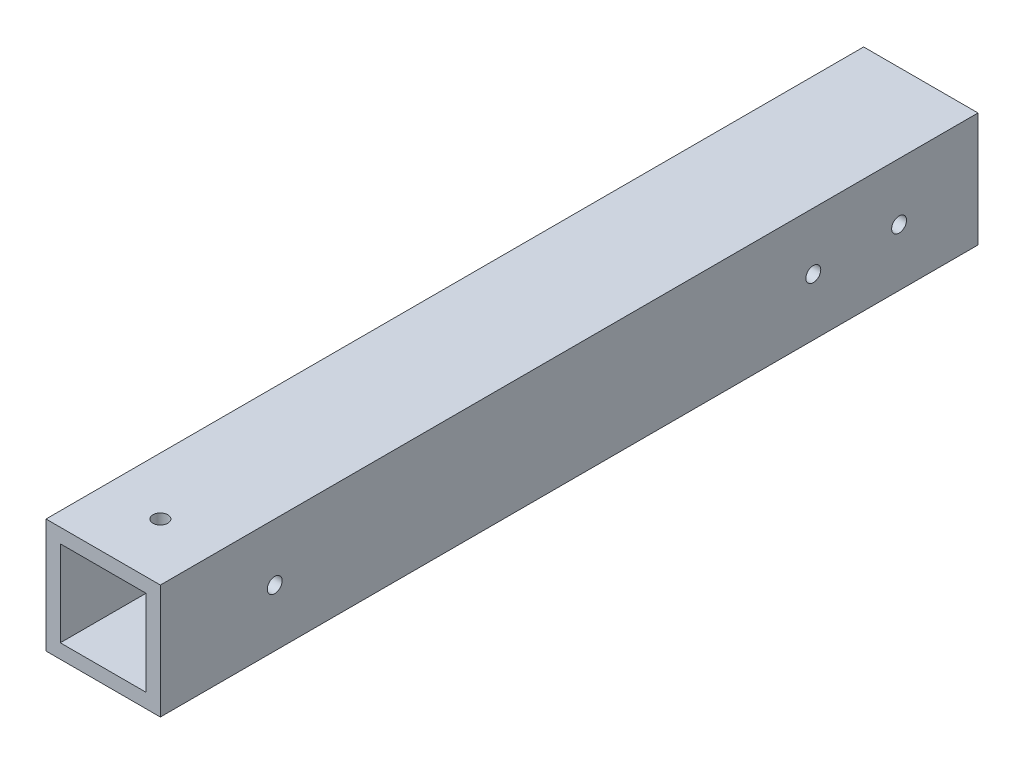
ISO-10303-21;
HEADER;
FILE_DESCRIPTION(('STEP AP214'),'2;1');
FILE_NAME('part.step','',(''),(''),'','','');
FILE_SCHEMA(('AUTOMOTIVE_DESIGN { 1 0 10303 214 1 1 1 1 }'));
ENDSEC;
DATA;
#1=APPLICATION_CONTEXT('core data for automotive mechanical design processes');
#2=APPLICATION_PROTOCOL_DEFINITION('international standard','automotive_design',2000,#1);
#3=PRODUCT_CONTEXT('',#1,'mechanical');
#4=PRODUCT('Part','Part','',(#3));
#5=PRODUCT_RELATED_PRODUCT_CATEGORY('part','',(#4));
#6=PRODUCT_DEFINITION_FORMATION('','',#4);
#7=PRODUCT_DEFINITION_CONTEXT('part definition',#1,'design');
#8=PRODUCT_DEFINITION('design','',#6,#7);
#9=PRODUCT_DEFINITION_SHAPE('','',#8);
#10=(LENGTH_UNIT() NAMED_UNIT(*) SI_UNIT(.MILLI.,.METRE.));
#11=(NAMED_UNIT(*) PLANE_ANGLE_UNIT() SI_UNIT($,.RADIAN.));
#12=(NAMED_UNIT(*) SI_UNIT($,.STERADIAN.) SOLID_ANGLE_UNIT());
#13=UNCERTAINTY_MEASURE_WITH_UNIT(LENGTH_MEASURE(1.E-05),#10,'distance_accuracy_value','');
#14=(GEOMETRIC_REPRESENTATION_CONTEXT(3) GLOBAL_UNCERTAINTY_ASSIGNED_CONTEXT((#13)) GLOBAL_UNIT_ASSIGNED_CONTEXT((#10,
#11,#12)) REPRESENTATION_CONTEXT('',''));
#15=CARTESIAN_POINT('',(0.,0.,0.));
#16=DIRECTION('',(0.,0.,1.));
#17=DIRECTION('',(1.,0.,0.));
#18=AXIS2_PLACEMENT_3D('',#15,#16,#17);
#19=CARTESIAN_POINT('',(0.,0.,-363.22));
#20=DIRECTION('',(-1.,0.,0.));
#21=DIRECTION('',(0.,0.,1.));
#22=AXIS2_PLACEMENT_3D('',#19,#20,#21);
#23=PLANE('',#22);
#24=CARTESIAN_POINT('',(0.,25.4,-328.168));
#25=DIRECTION('',(1.,0.,0.));
#26=DIRECTION('',(0.,0.,-1.));
#27=AXIS2_PLACEMENT_3D('',#24,#25,#26);
#28=CIRCLE('',#27,3.30200000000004);
#29=CARTESIAN_POINT('',(0.,25.4,-331.47));
#30=VERTEX_POINT('',#29);
#31=EDGE_CURVE('E241',#30,#30,#28,.T.);
#32=ORIENTED_EDGE('',*,*,#31,.T.);
#33=EDGE_LOOP('',(#32));
#34=FACE_BOUND('',#33,.T.);
#35=CARTESIAN_POINT('',(0.,25.4,-290.068));
#36=DIRECTION('',(1.,0.,0.));
#37=DIRECTION('',(0.,0.,-1.));
#38=AXIS2_PLACEMENT_3D('',#35,#36,#37);
#39=CIRCLE('',#38,3.30200000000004);
#40=CARTESIAN_POINT('',(0.,25.4,-293.37));
#41=VERTEX_POINT('',#40);
#42=EDGE_CURVE('E176',#41,#41,#39,.T.);
#43=ORIENTED_EDGE('',*,*,#42,.T.);
#44=EDGE_LOOP('',(#43));
#45=FACE_BOUND('',#44,.T.);
#46=CARTESIAN_POINT('',(0.,25.4,-50.8));
#47=DIRECTION('',(1.,0.,0.));
#48=DIRECTION('',(0.,0.,-1.));
#49=AXIS2_PLACEMENT_3D('',#46,#47,#48);
#50=CIRCLE('',#49,3.302);
#51=CARTESIAN_POINT('',(0.,25.4,-54.102));
#52=VERTEX_POINT('',#51);
#53=EDGE_CURVE('E172',#52,#52,#50,.T.);
#54=ORIENTED_EDGE('',*,*,#53,.T.);
#55=EDGE_LOOP('',(#54));
#56=FACE_BOUND('',#55,.T.);
#57=DIRECTION('',(0.,-1.,0.));
#58=VECTOR('',#57,1.);
#59=CARTESIAN_POINT('',(0.,0.,0.));
#60=LINE('',#59,#58);
#61=CARTESIAN_POINT('',(0.,50.8,0.));
#62=VERTEX_POINT('',#61);
#63=CARTESIAN_POINT('',(0.,0.,0.));
#64=VERTEX_POINT('',#63);
#65=EDGE_CURVE('E133',#62,#64,#60,.T.);
#66=ORIENTED_EDGE('',*,*,#65,.F.);
#67=DIRECTION('',(0.,0.,1.));
#68=VECTOR('',#67,1.);
#69=CARTESIAN_POINT('',(0.,50.8,-363.22));
#70=LINE('',#69,#68);
#71=CARTESIAN_POINT('',(0.,50.8,-363.22));
#72=VERTEX_POINT('',#71);
#73=EDGE_CURVE('E11',#72,#62,#70,.T.);
#74=ORIENTED_EDGE('',*,*,#73,.F.);
#75=DIRECTION('',(0.,-1.,0.));
#76=VECTOR('',#75,1.);
#77=CARTESIAN_POINT('',(0.,0.,-363.22));
#78=LINE('',#77,#76);
#79=CARTESIAN_POINT('',(0.,0.,-363.22));
#80=VERTEX_POINT('',#79);
#81=EDGE_CURVE('E137',#72,#80,#78,.T.);
#82=ORIENTED_EDGE('',*,*,#81,.T.);
#83=DIRECTION('',(0.,0.,1.));
#84=VECTOR('',#83,1.);
#85=CARTESIAN_POINT('',(0.,0.,-363.22));
#86=LINE('',#85,#84);
#87=EDGE_CURVE('E150',#80,#64,#86,.T.);
#88=ORIENTED_EDGE('',*,*,#87,.T.);
#89=EDGE_LOOP('',(#66,#74,#82,#88));
#90=FACE_BOUND('',#89,.T.);
#91=ADVANCED_FACE('F32',(#34,#45,#56,#90),#23,.T.);
#92=CARTESIAN_POINT('',(0.,50.8,-363.22));
#93=DIRECTION('',(0.,1.,0.));
#94=DIRECTION('',(0.,0.,1.));
#95=AXIS2_PLACEMENT_3D('',#92,#93,#94);
#96=PLANE('',#95);
#97=CARTESIAN_POINT('',(25.4,50.8,-25.4));
#98=DIRECTION('',(0.,1.,0.));
#99=DIRECTION('',(0.,0.,1.));
#100=AXIS2_PLACEMENT_3D('',#97,#98,#99);
#101=CIRCLE('',#100,3.302);
#102=CARTESIAN_POINT('',(25.4,50.8,-22.098));
#103=VERTEX_POINT('',#102);
#104=EDGE_CURVE('E199',#103,#103,#101,.T.);
#105=ORIENTED_EDGE('',*,*,#104,.F.);
#106=EDGE_LOOP('',(#105));
#107=FACE_BOUND('',#106,.T.);
#108=DIRECTION('',(-1.,0.,0.));
#109=VECTOR('',#108,1.);
#110=CARTESIAN_POINT('',(0.,50.8,0.));
#111=LINE('',#110,#109);
#112=CARTESIAN_POINT('',(50.8,50.8,0.));
#113=VERTEX_POINT('',#112);
#114=EDGE_CURVE('E141',#113,#62,#111,.T.);
#115=ORIENTED_EDGE('',*,*,#114,.F.);
#116=DIRECTION('',(0.,0.,1.));
#117=VECTOR('',#116,1.);
#118=CARTESIAN_POINT('',(50.8,50.8,-363.22));
#119=LINE('',#118,#117);
#120=CARTESIAN_POINT('',(50.8,50.8,-363.22));
#121=VERTEX_POINT('',#120);
#122=EDGE_CURVE('E40',#121,#113,#119,.T.);
#123=ORIENTED_EDGE('',*,*,#122,.F.);
#124=DIRECTION('',(-1.,0.,0.));
#125=VECTOR('',#124,1.);
#126=CARTESIAN_POINT('',(0.,50.8,-363.22));
#127=LINE('',#126,#125);
#128=EDGE_CURVE('E147',#121,#72,#127,.T.);
#129=ORIENTED_EDGE('',*,*,#128,.T.);
#130=ORIENTED_EDGE('',*,*,#73,.T.);
#131=EDGE_LOOP('',(#115,#123,#129,#130));
#132=FACE_BOUND('',#131,.T.);
#133=ADVANCED_FACE('F207',(#107,#132),#96,.T.);
#134=CARTESIAN_POINT('',(50.8,0.,-363.22));
#135=DIRECTION('',(1.,0.,0.));
#136=DIRECTION('',(0.,0.,-1.));
#137=AXIS2_PLACEMENT_3D('',#134,#135,#136);
#138=PLANE('',#137);
#139=CARTESIAN_POINT('',(50.8,25.4,-328.168));
#140=DIRECTION('',(1.,0.,0.));
#141=DIRECTION('',(0.,0.,-1.));
#142=AXIS2_PLACEMENT_3D('',#139,#140,#141);
#143=CIRCLE('',#142,3.30200000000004);
#144=CARTESIAN_POINT('',(50.8,25.4,-331.47));
#145=VERTEX_POINT('',#144);
#146=EDGE_CURVE('E294',#145,#145,#143,.T.);
#147=ORIENTED_EDGE('',*,*,#146,.F.);
#148=EDGE_LOOP('',(#147));
#149=FACE_BOUND('',#148,.T.);
#150=CARTESIAN_POINT('',(50.8,25.4,-290.068));
#151=DIRECTION('',(1.,0.,0.));
#152=DIRECTION('',(0.,0.,-1.));
#153=AXIS2_PLACEMENT_3D('',#150,#151,#152);
#154=CIRCLE('',#153,3.30200000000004);
#155=CARTESIAN_POINT('',(50.8,25.4,-293.37));
#156=VERTEX_POINT('',#155);
#157=EDGE_CURVE('E183',#156,#156,#154,.T.);
#158=ORIENTED_EDGE('',*,*,#157,.F.);
#159=EDGE_LOOP('',(#158));
#160=FACE_BOUND('',#159,.T.);
#161=CARTESIAN_POINT('',(50.8,25.4,-50.8));
#162=DIRECTION('',(1.,0.,0.));
#163=DIRECTION('',(0.,0.,-1.));
#164=AXIS2_PLACEMENT_3D('',#161,#162,#163);
#165=CIRCLE('',#164,3.302);
#166=CARTESIAN_POINT('',(50.8,25.4,-54.102));
#167=VERTEX_POINT('',#166);
#168=EDGE_CURVE('E180',#167,#167,#165,.T.);
#169=ORIENTED_EDGE('',*,*,#168,.F.);
#170=EDGE_LOOP('',(#169));
#171=FACE_BOUND('',#170,.T.);
#172=DIRECTION('',(0.,1.,0.));
#173=VECTOR('',#172,1.);
#174=CARTESIAN_POINT('',(50.8,0.,0.));
#175=LINE('',#174,#173);
#176=CARTESIAN_POINT('',(50.8,0.,0.));
#177=VERTEX_POINT('',#176);
#178=EDGE_CURVE('E156',#177,#113,#175,.T.);
#179=ORIENTED_EDGE('',*,*,#178,.F.);
#180=DIRECTION('',(0.,0.,1.));
#181=VECTOR('',#180,1.);
#182=CARTESIAN_POINT('',(50.8,0.,-363.22));
#183=LINE('',#182,#181);
#184=CARTESIAN_POINT('',(50.8,0.,-363.22));
#185=VERTEX_POINT('',#184);
#186=EDGE_CURVE('E162',#185,#177,#183,.T.);
#187=ORIENTED_EDGE('',*,*,#186,.F.);
#188=DIRECTION('',(0.,1.,0.));
#189=VECTOR('',#188,1.);
#190=CARTESIAN_POINT('',(50.8,0.,-363.22));
#191=LINE('',#190,#189);
#192=EDGE_CURVE('E144',#185,#121,#191,.T.);
#193=ORIENTED_EDGE('',*,*,#192,.T.);
#194=ORIENTED_EDGE('',*,*,#122,.T.);
#195=EDGE_LOOP('',(#179,#187,#193,#194));
#196=FACE_BOUND('',#195,.T.);
#197=ADVANCED_FACE('F210',(#149,#160,#171,#196),#138,.T.);
#198=CARTESIAN_POINT('',(0.,0.,-363.22));
#199=DIRECTION('',(0.,-1.,0.));
#200=DIRECTION('',(0.,0.,-1.));
#201=AXIS2_PLACEMENT_3D('',#198,#199,#200);
#202=PLANE('',#201);
#203=CARTESIAN_POINT('',(25.4,0.,-25.4));
#204=DIRECTION('',(0.,1.,0.));
#205=DIRECTION('',(0.,0.,1.));
#206=AXIS2_PLACEMENT_3D('',#203,#204,#205);
#207=CIRCLE('',#206,3.302);
#208=CARTESIAN_POINT('',(25.4,0.,-22.098));
#209=VERTEX_POINT('',#208);
#210=EDGE_CURVE('E168',#209,#209,#207,.T.);
#211=ORIENTED_EDGE('',*,*,#210,.T.);
#212=EDGE_LOOP('',(#211));
#213=FACE_BOUND('',#212,.T.);
#214=DIRECTION('',(1.,0.,0.));
#215=VECTOR('',#214,1.);
#216=CARTESIAN_POINT('',(0.,0.,0.));
#217=LINE('',#216,#215);
#218=EDGE_CURVE('E153',#64,#177,#217,.T.);
#219=ORIENTED_EDGE('',*,*,#218,.F.);
#220=ORIENTED_EDGE('',*,*,#87,.F.);
#221=DIRECTION('',(1.,0.,0.));
#222=VECTOR('',#221,1.);
#223=CARTESIAN_POINT('',(0.,0.,-363.22));
#224=LINE('',#223,#222);
#225=EDGE_CURVE('E140',#80,#185,#224,.T.);
#226=ORIENTED_EDGE('',*,*,#225,.T.);
#227=ORIENTED_EDGE('',*,*,#186,.T.);
#228=EDGE_LOOP('',(#219,#220,#226,#227));
#229=FACE_BOUND('',#228,.T.);
#230=ADVANCED_FACE('F225',(#213,#229),#202,.T.);
#231=CARTESIAN_POINT('',(0.,50.8,-363.22));
#232=DIRECTION('',(0.,0.,-1.));
#233=DIRECTION('',(-1.,0.,0.));
#234=AXIS2_PLACEMENT_3D('',#231,#232,#233);
#235=PLANE('',#234);
#236=DIRECTION('',(0.,-1.,0.));
#237=VECTOR('',#236,1.);
#238=CARTESIAN_POINT('',(6.35,6.35,-363.22));
#239=LINE('',#238,#237);
#240=CARTESIAN_POINT('',(6.35,44.45,-363.22));
#241=VERTEX_POINT('',#240);
#242=CARTESIAN_POINT('',(6.35,6.35,-363.22));
#243=VERTEX_POINT('',#242);
#244=EDGE_CURVE('E99',#241,#243,#239,.T.);
#245=ORIENTED_EDGE('',*,*,#244,.T.);
#246=DIRECTION('',(1.,0.,0.));
#247=VECTOR('',#246,1.);
#248=CARTESIAN_POINT('',(6.35,6.35,-363.22));
#249=LINE('',#248,#247);
#250=CARTESIAN_POINT('',(44.45,6.35,-363.22));
#251=VERTEX_POINT('',#250);
#252=EDGE_CURVE('E108',#243,#251,#249,.T.);
#253=ORIENTED_EDGE('',*,*,#252,.T.);
#254=DIRECTION('',(0.,1.,0.));
#255=VECTOR('',#254,1.);
#256=CARTESIAN_POINT('',(44.45,6.35,-363.22));
#257=LINE('',#256,#255);
#258=CARTESIAN_POINT('',(44.45,44.45,-363.22));
#259=VERTEX_POINT('',#258);
#260=EDGE_CURVE('E48',#251,#259,#257,.T.);
#261=ORIENTED_EDGE('',*,*,#260,.T.);
#262=DIRECTION('',(-1.,0.,0.));
#263=VECTOR('',#262,1.);
#264=CARTESIAN_POINT('',(6.35,44.45,-363.22));
#265=LINE('',#264,#263);
#266=EDGE_CURVE('E105',#259,#241,#265,.T.);
#267=ORIENTED_EDGE('',*,*,#266,.T.);
#268=EDGE_LOOP('',(#245,#253,#261,#267));
#269=FACE_BOUND('',#268,.T.);
#270=ORIENTED_EDGE('',*,*,#81,.F.);
#271=ORIENTED_EDGE('',*,*,#128,.F.);
#272=ORIENTED_EDGE('',*,*,#192,.F.);
#273=ORIENTED_EDGE('',*,*,#225,.F.);
#274=EDGE_LOOP('',(#270,#271,#272,#273));
#275=FACE_BOUND('',#274,.T.);
#276=ADVANCED_FACE('F112',(#269,#275),#235,.T.);
#277=CARTESIAN_POINT('',(0.,50.8,0.));
#278=DIRECTION('',(0.,0.,-1.));
#279=DIRECTION('',(-1.,0.,0.));
#280=AXIS2_PLACEMENT_3D('',#277,#278,#279);
#281=PLANE('',#280);
#282=DIRECTION('',(1.,0.,0.));
#283=VECTOR('',#282,1.);
#284=CARTESIAN_POINT('',(6.35,6.35,0.));
#285=LINE('',#284,#283);
#286=CARTESIAN_POINT('',(6.35,6.35,0.));
#287=VERTEX_POINT('',#286);
#288=CARTESIAN_POINT('',(44.45,6.35,0.));
#289=VERTEX_POINT('',#288);
#290=EDGE_CURVE('E127',#287,#289,#285,.T.);
#291=ORIENTED_EDGE('',*,*,#290,.F.);
#292=DIRECTION('',(0.,-1.,0.));
#293=VECTOR('',#292,1.);
#294=CARTESIAN_POINT('',(6.35,6.35,0.));
#295=LINE('',#294,#293);
#296=CARTESIAN_POINT('',(6.35,44.45,0.));
#297=VERTEX_POINT('',#296);
#298=EDGE_CURVE('E56',#297,#287,#295,.T.);
#299=ORIENTED_EDGE('',*,*,#298,.F.);
#300=DIRECTION('',(-1.,0.,0.));
#301=VECTOR('',#300,1.);
#302=CARTESIAN_POINT('',(6.35,44.45,0.));
#303=LINE('',#302,#301);
#304=CARTESIAN_POINT('',(44.45,44.45,0.));
#305=VERTEX_POINT('',#304);
#306=EDGE_CURVE('E115',#305,#297,#303,.T.);
#307=ORIENTED_EDGE('',*,*,#306,.F.);
#308=DIRECTION('',(0.,1.,0.));
#309=VECTOR('',#308,1.);
#310=CARTESIAN_POINT('',(44.45,6.35,0.));
#311=LINE('',#310,#309);
#312=EDGE_CURVE('E118',#289,#305,#311,.T.);
#313=ORIENTED_EDGE('',*,*,#312,.F.);
#314=EDGE_LOOP('',(#291,#299,#307,#313));
#315=FACE_BOUND('',#314,.T.);
#316=ORIENTED_EDGE('',*,*,#65,.T.);
#317=ORIENTED_EDGE('',*,*,#218,.T.);
#318=ORIENTED_EDGE('',*,*,#178,.T.);
#319=ORIENTED_EDGE('',*,*,#114,.T.);
#320=EDGE_LOOP('',(#316,#317,#318,#319));
#321=FACE_BOUND('',#320,.T.);
#322=ADVANCED_FACE('F215',(#315,#321),#281,.F.);
#323=CARTESIAN_POINT('',(6.35,6.35,-363.22));
#324=DIRECTION('',(-1.,0.,0.));
#325=DIRECTION('',(0.,0.,1.));
#326=AXIS2_PLACEMENT_3D('',#323,#324,#325);
#327=PLANE('',#326);
#328=CARTESIAN_POINT('',(6.35,25.4,-328.168));
#329=DIRECTION('',(-1.,0.,0.));
#330=DIRECTION('',(0.,0.,1.));
#331=AXIS2_PLACEMENT_3D('',#328,#329,#330);
#332=CIRCLE('',#331,3.30200000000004);
#333=CARTESIAN_POINT('',(6.35,25.4,-324.866));
#334=VERTEX_POINT('',#333);
#335=EDGE_CURVE('E188',#334,#334,#332,.T.);
#336=ORIENTED_EDGE('',*,*,#335,.T.);
#337=EDGE_LOOP('',(#336));
#338=FACE_BOUND('',#337,.T.);
#339=CARTESIAN_POINT('',(6.35,25.4,-290.068));
#340=DIRECTION('',(-1.,0.,0.));
#341=DIRECTION('',(0.,0.,1.));
#342=AXIS2_PLACEMENT_3D('',#339,#340,#341);
#343=CIRCLE('',#342,3.30200000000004);
#344=CARTESIAN_POINT('',(6.35,25.4,-286.766));
#345=VERTEX_POINT('',#344);
#346=EDGE_CURVE('E175',#345,#345,#343,.T.);
#347=ORIENTED_EDGE('',*,*,#346,.T.);
#348=EDGE_LOOP('',(#347));
#349=FACE_BOUND('',#348,.T.);
#350=CARTESIAN_POINT('',(6.35,25.4,-50.8));
#351=DIRECTION('',(-1.,0.,0.));
#352=DIRECTION('',(0.,0.,1.));
#353=AXIS2_PLACEMENT_3D('',#350,#351,#352);
#354=CIRCLE('',#353,3.302);
#355=CARTESIAN_POINT('',(6.35,25.4,-47.498));
#356=VERTEX_POINT('',#355);
#357=EDGE_CURVE('E171',#356,#356,#354,.T.);
#358=ORIENTED_EDGE('',*,*,#357,.T.);
#359=EDGE_LOOP('',(#358));
#360=FACE_BOUND('',#359,.T.);
#361=ORIENTED_EDGE('',*,*,#298,.T.);
#362=DIRECTION('',(0.,0.,1.));
#363=VECTOR('',#362,1.);
#364=CARTESIAN_POINT('',(6.35,6.35,-363.22));
#365=LINE('',#364,#363);
#366=EDGE_CURVE('E95',#243,#287,#365,.T.);
#367=ORIENTED_EDGE('',*,*,#366,.F.);
#368=ORIENTED_EDGE('',*,*,#244,.F.);
#369=DIRECTION('',(0.,0.,1.));
#370=VECTOR('',#369,1.);
#371=CARTESIAN_POINT('',(6.35,44.45,-363.22));
#372=LINE('',#371,#370);
#373=EDGE_CURVE('E131',#241,#297,#372,.T.);
#374=ORIENTED_EDGE('',*,*,#373,.T.);
#375=EDGE_LOOP('',(#361,#367,#368,#374));
#376=FACE_BOUND('',#375,.T.);
#377=ADVANCED_FACE('F97',(#338,#349,#360,#376),#327,.F.);
#378=CARTESIAN_POINT('',(6.35,44.45,-363.22));
#379=DIRECTION('',(0.,1.,0.));
#380=DIRECTION('',(0.,0.,1.));
#381=AXIS2_PLACEMENT_3D('',#378,#379,#380);
#382=PLANE('',#381);
#383=CARTESIAN_POINT('',(25.4,44.45,-25.4));
#384=DIRECTION('',(0.,1.,0.));
#385=DIRECTION('',(0.,0.,1.));
#386=AXIS2_PLACEMENT_3D('',#383,#384,#385);
#387=CIRCLE('',#386,3.302);
#388=CARTESIAN_POINT('',(25.4,44.45,-22.098));
#389=VERTEX_POINT('',#388);
#390=EDGE_CURVE('E121',#389,#389,#387,.T.);
#391=ORIENTED_EDGE('',*,*,#390,.T.);
#392=EDGE_LOOP('',(#391));
#393=FACE_BOUND('',#392,.T.);
#394=ORIENTED_EDGE('',*,*,#306,.T.);
#395=ORIENTED_EDGE('',*,*,#373,.F.);
#396=ORIENTED_EDGE('',*,*,#266,.F.);
#397=DIRECTION('',(0.,0.,1.));
#398=VECTOR('',#397,1.);
#399=CARTESIAN_POINT('',(44.45,44.45,-363.22));
#400=LINE('',#399,#398);
#401=EDGE_CURVE('E134',#259,#305,#400,.T.);
#402=ORIENTED_EDGE('',*,*,#401,.T.);
#403=EDGE_LOOP('',(#394,#395,#396,#402));
#404=FACE_BOUND('',#403,.T.);
#405=ADVANCED_FACE('F254',(#393,#404),#382,.F.);
#406=CARTESIAN_POINT('',(44.45,6.35,-363.22));
#407=DIRECTION('',(1.,0.,0.));
#408=DIRECTION('',(0.,0.,-1.));
#409=AXIS2_PLACEMENT_3D('',#406,#407,#408);
#410=PLANE('',#409);
#411=CARTESIAN_POINT('',(44.45,25.4,-328.168));
#412=DIRECTION('',(1.,0.,0.));
#413=DIRECTION('',(0.,0.,-1.));
#414=AXIS2_PLACEMENT_3D('',#411,#412,#413);
#415=CIRCLE('',#414,3.30200000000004);
#416=CARTESIAN_POINT('',(44.45,25.4,-331.47));
#417=VERTEX_POINT('',#416);
#418=EDGE_CURVE('E35',#417,#417,#415,.T.);
#419=ORIENTED_EDGE('',*,*,#418,.T.);
#420=EDGE_LOOP('',(#419));
#421=FACE_BOUND('',#420,.T.);
#422=CARTESIAN_POINT('',(44.45,25.4,-290.068));
#423=DIRECTION('',(1.,0.,0.));
#424=DIRECTION('',(0.,0.,-1.));
#425=AXIS2_PLACEMENT_3D('',#422,#423,#424);
#426=CIRCLE('',#425,3.30200000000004);
#427=CARTESIAN_POINT('',(44.45,25.4,-293.37));
#428=VERTEX_POINT('',#427);
#429=EDGE_CURVE('E173',#428,#428,#426,.T.);
#430=ORIENTED_EDGE('',*,*,#429,.T.);
#431=EDGE_LOOP('',(#430));
#432=FACE_BOUND('',#431,.T.);
#433=CARTESIAN_POINT('',(44.45,25.4,-50.8));
#434=DIRECTION('',(1.,0.,0.));
#435=DIRECTION('',(0.,0.,-1.));
#436=AXIS2_PLACEMENT_3D('',#433,#434,#435);
#437=CIRCLE('',#436,3.302);
#438=CARTESIAN_POINT('',(44.45,25.4,-54.102));
#439=VERTEX_POINT('',#438);
#440=EDGE_CURVE('E169',#439,#439,#437,.T.);
#441=ORIENTED_EDGE('',*,*,#440,.T.);
#442=EDGE_LOOP('',(#441));
#443=FACE_BOUND('',#442,.T.);
#444=ORIENTED_EDGE('',*,*,#312,.T.);
#445=ORIENTED_EDGE('',*,*,#401,.F.);
#446=ORIENTED_EDGE('',*,*,#260,.F.);
#447=DIRECTION('',(0.,0.,1.));
#448=VECTOR('',#447,1.);
#449=CARTESIAN_POINT('',(44.45,6.35,-363.22));
#450=LINE('',#449,#448);
#451=EDGE_CURVE('E104',#251,#289,#450,.T.);
#452=ORIENTED_EDGE('',*,*,#451,.T.);
#453=EDGE_LOOP('',(#444,#445,#446,#452));
#454=FACE_BOUND('',#453,.T.);
#455=ADVANCED_FACE('F261',(#421,#432,#443,#454),#410,.F.);
#456=CARTESIAN_POINT('',(6.35,6.35,-363.22));
#457=DIRECTION('',(0.,-1.,0.));
#458=DIRECTION('',(0.,0.,-1.));
#459=AXIS2_PLACEMENT_3D('',#456,#457,#458);
#460=PLANE('',#459);
#461=CARTESIAN_POINT('',(25.4,6.35,-25.4));
#462=DIRECTION('',(0.,-1.,0.));
#463=DIRECTION('',(0.,0.,-1.));
#464=AXIS2_PLACEMENT_3D('',#461,#462,#463);
#465=CIRCLE('',#464,3.302);
#466=CARTESIAN_POINT('',(25.4,6.35,-28.702));
#467=VERTEX_POINT('',#466);
#468=EDGE_CURVE('E165',#467,#467,#465,.T.);
#469=ORIENTED_EDGE('',*,*,#468,.T.);
#470=EDGE_LOOP('',(#469));
#471=FACE_BOUND('',#470,.T.);
#472=ORIENTED_EDGE('',*,*,#290,.T.);
#473=ORIENTED_EDGE('',*,*,#451,.F.);
#474=ORIENTED_EDGE('',*,*,#252,.F.);
#475=ORIENTED_EDGE('',*,*,#366,.T.);
#476=EDGE_LOOP('',(#472,#473,#474,#475));
#477=FACE_BOUND('',#476,.T.);
#478=ADVANCED_FACE('F109',(#471,#477),#460,.F.);
#479=CARTESIAN_POINT('',(25.4,0.,-25.4));
#480=DIRECTION('',(0.,1.,0.));
#481=DIRECTION('',(0.,0.,1.));
#482=AXIS2_PLACEMENT_3D('',#479,#480,#481);
#483=CYLINDRICAL_SURFACE('',#482,3.302);
#484=ORIENTED_EDGE('',*,*,#210,.F.);
#485=EDGE_LOOP('',(#484));
#486=FACE_BOUND('',#485,.T.);
#487=ORIENTED_EDGE('',*,*,#468,.F.);
#488=EDGE_LOOP('',(#487));
#489=FACE_BOUND('',#488,.T.);
#490=ADVANCED_FACE('F271',(#486,#489),#483,.F.);
#491=ORIENTED_EDGE('',*,*,#104,.T.);
#492=EDGE_LOOP('',(#491));
#493=FACE_BOUND('',#492,.T.);
#494=ORIENTED_EDGE('',*,*,#390,.F.);
#495=EDGE_LOOP('',(#494));
#496=FACE_BOUND('',#495,.T.);
#497=ADVANCED_FACE('F204',(#493,#496),#483,.F.);
#498=CARTESIAN_POINT('',(0.,25.4,-50.8));
#499=DIRECTION('',(1.,0.,0.));
#500=DIRECTION('',(0.,0.,-1.));
#501=AXIS2_PLACEMENT_3D('',#498,#499,#500);
#502=CYLINDRICAL_SURFACE('',#501,3.302);
#503=ORIENTED_EDGE('',*,*,#168,.T.);
#504=EDGE_LOOP('',(#503));
#505=FACE_BOUND('',#504,.T.);
#506=ORIENTED_EDGE('',*,*,#440,.F.);
#507=EDGE_LOOP('',(#506));
#508=FACE_BOUND('',#507,.T.);
#509=ADVANCED_FACE('F249',(#505,#508),#502,.F.);
#510=ORIENTED_EDGE('',*,*,#53,.F.);
#511=EDGE_LOOP('',(#510));
#512=FACE_BOUND('',#511,.T.);
#513=ORIENTED_EDGE('',*,*,#357,.F.);
#514=EDGE_LOOP('',(#513));
#515=FACE_BOUND('',#514,.T.);
#516=ADVANCED_FACE('F245',(#512,#515),#502,.F.);
#517=CARTESIAN_POINT('',(0.,25.4,-290.068));
#518=DIRECTION('',(1.,0.,0.));
#519=DIRECTION('',(0.,0.,-1.));
#520=AXIS2_PLACEMENT_3D('',#517,#518,#519);
#521=CYLINDRICAL_SURFACE('',#520,3.30200000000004);
#522=ORIENTED_EDGE('',*,*,#157,.T.);
#523=EDGE_LOOP('',(#522));
#524=FACE_BOUND('',#523,.T.);
#525=ORIENTED_EDGE('',*,*,#429,.F.);
#526=EDGE_LOOP('',(#525));
#527=FACE_BOUND('',#526,.T.);
#528=ADVANCED_FACE('F248',(#524,#527),#521,.F.);
#529=ORIENTED_EDGE('',*,*,#42,.F.);
#530=EDGE_LOOP('',(#529));
#531=FACE_BOUND('',#530,.T.);
#532=ORIENTED_EDGE('',*,*,#346,.F.);
#533=EDGE_LOOP('',(#532));
#534=FACE_BOUND('',#533,.T.);
#535=ADVANCED_FACE('F278',(#531,#534),#521,.F.);
#536=CARTESIAN_POINT('',(0.,25.4,-328.168));
#537=DIRECTION('',(1.,0.,0.));
#538=DIRECTION('',(0.,0.,-1.));
#539=AXIS2_PLACEMENT_3D('',#536,#537,#538);
#540=CYLINDRICAL_SURFACE('',#539,3.30200000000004);
#541=ORIENTED_EDGE('',*,*,#146,.T.);
#542=EDGE_LOOP('',(#541));
#543=FACE_BOUND('',#542,.T.);
#544=ORIENTED_EDGE('',*,*,#418,.F.);
#545=EDGE_LOOP('',(#544));
#546=FACE_BOUND('',#545,.T.);
#547=ADVANCED_FACE('F281',(#543,#546),#540,.F.);
#548=ORIENTED_EDGE('',*,*,#31,.F.);
#549=EDGE_LOOP('',(#548));
#550=FACE_BOUND('',#549,.T.);
#551=ORIENTED_EDGE('',*,*,#335,.F.);
#552=EDGE_LOOP('',(#551));
#553=FACE_BOUND('',#552,.T.);
#554=ADVANCED_FACE('F283',(#550,#553),#540,.F.);
#555=CLOSED_SHELL('',(#91,#133,#197,#230,#276,#322,#377,#405,#455,#478,#490,#497,#509,#516,#528,
#535,#547,#554));
#556=MANIFOLD_SOLID_BREP('B2',#555);
#557=ADVANCED_BREP_SHAPE_REPRESENTATION('',(#18,#556),#14);
#558=SHAPE_DEFINITION_REPRESENTATION(#9,#557);
ENDSEC;
END-ISO-10303-21;
